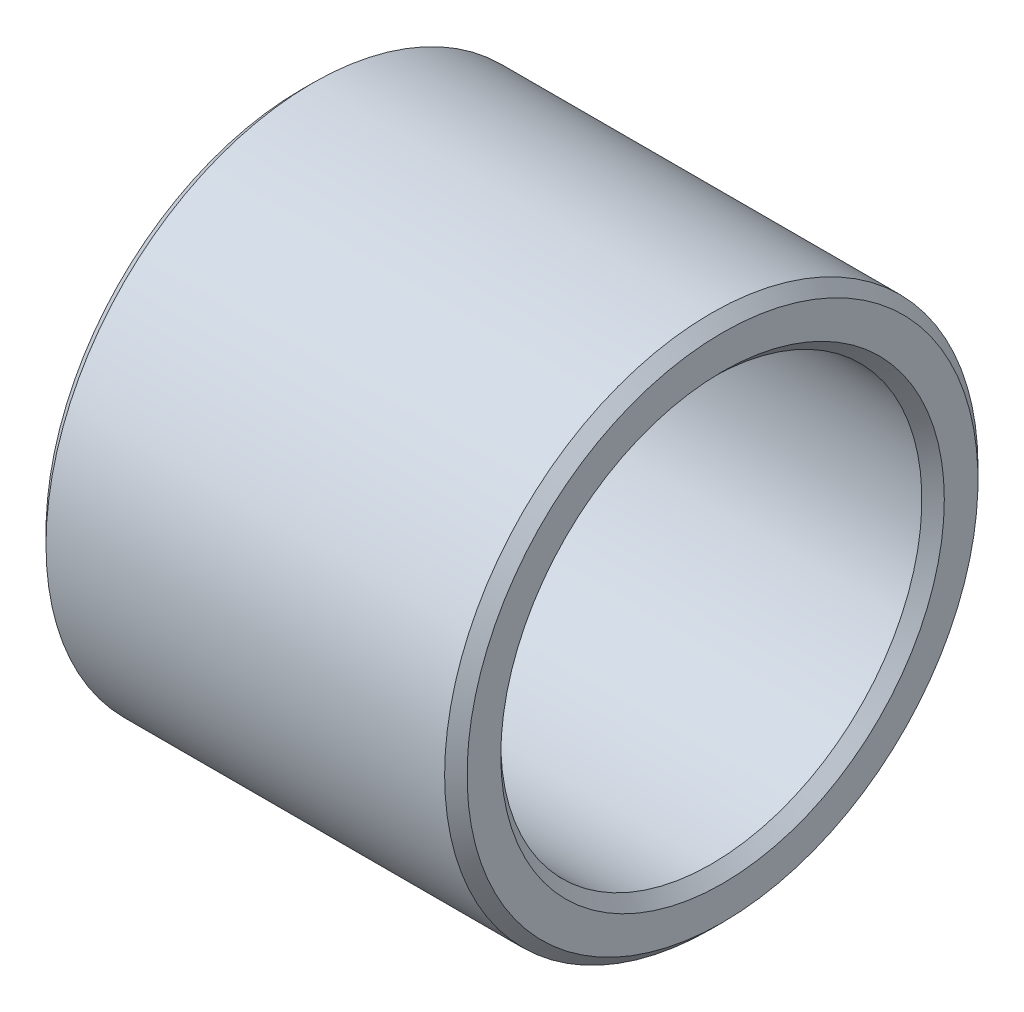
ISO-10303-21;
HEADER;
FILE_DESCRIPTION(('STEP AP214'),'2;1');
FILE_NAME('part.step','',(''),(''),'','','');
FILE_SCHEMA(('AUTOMOTIVE_DESIGN { 1 0 10303 214 1 1 1 1 }'));
ENDSEC;
DATA;
#1=APPLICATION_CONTEXT('core data for automotive mechanical design processes');
#2=APPLICATION_PROTOCOL_DEFINITION('international standard','automotive_design',2000,#1);
#3=PRODUCT_CONTEXT('',#1,'mechanical');
#4=PRODUCT('Part','Part','',(#3));
#5=PRODUCT_RELATED_PRODUCT_CATEGORY('part','',(#4));
#6=PRODUCT_DEFINITION_FORMATION('','',#4);
#7=PRODUCT_DEFINITION_CONTEXT('part definition',#1,'design');
#8=PRODUCT_DEFINITION('design','',#6,#7);
#9=PRODUCT_DEFINITION_SHAPE('','',#8);
#10=(LENGTH_UNIT() NAMED_UNIT(*) SI_UNIT(.MILLI.,.METRE.));
#11=(NAMED_UNIT(*) PLANE_ANGLE_UNIT() SI_UNIT($,.RADIAN.));
#12=(NAMED_UNIT(*) SI_UNIT($,.STERADIAN.) SOLID_ANGLE_UNIT());
#13=UNCERTAINTY_MEASURE_WITH_UNIT(LENGTH_MEASURE(1.E-05),#10,'distance_accuracy_value','');
#14=(GEOMETRIC_REPRESENTATION_CONTEXT(3) GLOBAL_UNCERTAINTY_ASSIGNED_CONTEXT((#13)) GLOBAL_UNIT_ASSIGNED_CONTEXT((#10,
#11,#12)) REPRESENTATION_CONTEXT('',''));
#15=CARTESIAN_POINT('',(0.,0.,0.));
#16=DIRECTION('',(0.,0.,1.));
#17=DIRECTION('',(1.,0.,0.));
#18=AXIS2_PLACEMENT_3D('',#15,#16,#17);
#19=CARTESIAN_POINT('',(0.,-8.5,0.));
#20=DIRECTION('',(-1.,0.,0.));
#21=DIRECTION('',(0.,1.,0.));
#22=AXIS2_PLACEMENT_3D('',#19,#20,#21);
#23=PLANE('',#22);
#24=CARTESIAN_POINT('',(0.,0.,0.));
#25=DIRECTION('',(1.,0.,0.));
#26=DIRECTION('',(0.,-1.,0.));
#27=AXIS2_PLACEMENT_3D('',#24,#25,#26);
#28=CIRCLE('',#27,7.9);
#29=CARTESIAN_POINT('',(0.,-7.9,0.));
#30=VERTEX_POINT('',#29);
#31=EDGE_CURVE('E9',#30,#30,#28,.T.);
#32=ORIENTED_EDGE('',*,*,#31,.T.);
#33=EDGE_LOOP('',(#32));
#34=FACE_BOUND('',#33,.T.);
#35=CARTESIAN_POINT('',(0.,0.,0.));
#36=DIRECTION('',(1.,0.,0.));
#37=DIRECTION('',(0.,-1.,0.));
#38=AXIS2_PLACEMENT_3D('',#35,#36,#37);
#39=CIRCLE('',#38,9.1);
#40=CARTESIAN_POINT('',(0.,-9.1,0.));
#41=VERTEX_POINT('',#40);
#42=EDGE_CURVE('E56',#41,#41,#39,.T.);
#43=ORIENTED_EDGE('',*,*,#42,.F.);
#44=EDGE_LOOP('',(#43));
#45=FACE_BOUND('',#44,.T.);
#46=ADVANCED_FACE('F15',(#34,#45),#23,.T.);
#47=CARTESIAN_POINT('',(0.2,0.,0.));
#48=DIRECTION('',(-1.,0.,0.));
#49=DIRECTION('',(0.,-1.,0.));
#50=AXIS2_PLACEMENT_3D('',#47,#48,#49);
#51=CONICAL_SURFACE('',#50,7.7,0.785398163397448);
#52=CARTESIAN_POINT('',(0.4,0.,0.));
#53=DIRECTION('',(1.,0.,0.));
#54=DIRECTION('',(0.,-1.,0.));
#55=AXIS2_PLACEMENT_3D('',#52,#53,#54);
#56=CIRCLE('',#55,7.5);
#57=CARTESIAN_POINT('',(0.4,-7.5,0.));
#58=VERTEX_POINT('',#57);
#59=EDGE_CURVE('E22',#58,#58,#56,.T.);
#60=ORIENTED_EDGE('',*,*,#59,.T.);
#61=EDGE_LOOP('',(#60));
#62=FACE_BOUND('',#61,.T.);
#63=ORIENTED_EDGE('',*,*,#31,.F.);
#64=EDGE_LOOP('',(#63));
#65=FACE_BOUND('',#64,.T.);
#66=ADVANCED_FACE('F81',(#62,#65),#51,.F.);
#67=CARTESIAN_POINT('',(7.5,0.,0.));
#68=DIRECTION('',(-1.,0.,0.));
#69=DIRECTION('',(0.,-1.,0.));
#70=AXIS2_PLACEMENT_3D('',#67,#68,#69);
#71=CYLINDRICAL_SURFACE('',#70,7.5);
#72=CARTESIAN_POINT('',(14.6,0.,0.));
#73=DIRECTION('',(1.,0.,0.));
#74=DIRECTION('',(0.,-1.,0.));
#75=AXIS2_PLACEMENT_3D('',#72,#73,#74);
#76=CIRCLE('',#75,7.5);
#77=CARTESIAN_POINT('',(14.6,-7.5,0.));
#78=VERTEX_POINT('',#77);
#79=EDGE_CURVE('E47',#78,#78,#76,.T.);
#80=ORIENTED_EDGE('',*,*,#79,.T.);
#81=EDGE_LOOP('',(#80));
#82=FACE_BOUND('',#81,.T.);
#83=ORIENTED_EDGE('',*,*,#59,.F.);
#84=EDGE_LOOP('',(#83));
#85=FACE_BOUND('',#84,.T.);
#86=ADVANCED_FACE('F85',(#82,#85),#71,.F.);
#87=CARTESIAN_POINT('',(14.8,0.,0.));
#88=DIRECTION('',(1.,0.,0.));
#89=DIRECTION('',(0.,-1.,0.));
#90=AXIS2_PLACEMENT_3D('',#87,#88,#89);
#91=CONICAL_SURFACE('',#90,7.7,0.785398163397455);
#92=CARTESIAN_POINT('',(15.,0.,0.));
#93=DIRECTION('',(1.,0.,0.));
#94=DIRECTION('',(0.,-1.,0.));
#95=AXIS2_PLACEMENT_3D('',#92,#93,#94);
#96=CIRCLE('',#95,7.9);
#97=CARTESIAN_POINT('',(15.,-7.9,0.));
#98=VERTEX_POINT('',#97);
#99=EDGE_CURVE('E43',#98,#98,#96,.T.);
#100=ORIENTED_EDGE('',*,*,#99,.T.);
#101=EDGE_LOOP('',(#100));
#102=FACE_BOUND('',#101,.T.);
#103=ORIENTED_EDGE('',*,*,#79,.F.);
#104=EDGE_LOOP('',(#103));
#105=FACE_BOUND('',#104,.T.);
#106=ADVANCED_FACE('F44',(#102,#105),#91,.F.);
#107=CARTESIAN_POINT('',(15.,-8.5,0.));
#108=DIRECTION('',(1.,0.,0.));
#109=DIRECTION('',(0.,-1.,0.));
#110=AXIS2_PLACEMENT_3D('',#107,#108,#109);
#111=PLANE('',#110);
#112=CARTESIAN_POINT('',(15.,0.,0.));
#113=DIRECTION('',(1.,0.,0.));
#114=DIRECTION('',(0.,-1.,0.));
#115=AXIS2_PLACEMENT_3D('',#112,#113,#114);
#116=CIRCLE('',#115,9.1);
#117=CARTESIAN_POINT('',(15.,-9.1,0.));
#118=VERTEX_POINT('',#117);
#119=EDGE_CURVE('E48',#118,#118,#116,.T.);
#120=ORIENTED_EDGE('',*,*,#119,.T.);
#121=EDGE_LOOP('',(#120));
#122=FACE_BOUND('',#121,.T.);
#123=ORIENTED_EDGE('',*,*,#99,.F.);
#124=EDGE_LOOP('',(#123));
#125=FACE_BOUND('',#124,.T.);
#126=ADVANCED_FACE('F92',(#122,#125),#111,.T.);
#127=CARTESIAN_POINT('',(14.8,0.,0.));
#128=DIRECTION('',(-1.,0.,0.));
#129=DIRECTION('',(0.,-1.,0.));
#130=AXIS2_PLACEMENT_3D('',#127,#128,#129);
#131=CONICAL_SURFACE('',#130,9.3,0.785398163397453);
#132=CARTESIAN_POINT('',(14.6,0.,0.));
#133=DIRECTION('',(1.,0.,0.));
#134=DIRECTION('',(0.,-1.,0.));
#135=AXIS2_PLACEMENT_3D('',#132,#133,#134);
#136=CIRCLE('',#135,9.5);
#137=CARTESIAN_POINT('',(14.6,-9.5,0.));
#138=VERTEX_POINT('',#137);
#139=EDGE_CURVE('E51',#138,#138,#136,.T.);
#140=ORIENTED_EDGE('',*,*,#139,.T.);
#141=EDGE_LOOP('',(#140));
#142=FACE_BOUND('',#141,.T.);
#143=ORIENTED_EDGE('',*,*,#119,.F.);
#144=EDGE_LOOP('',(#143));
#145=FACE_BOUND('',#144,.T.);
#146=ADVANCED_FACE('F77',(#142,#145),#131,.T.);
#147=CARTESIAN_POINT('',(7.5,0.,0.));
#148=DIRECTION('',(-1.,0.,0.));
#149=DIRECTION('',(0.,-1.,0.));
#150=AXIS2_PLACEMENT_3D('',#147,#148,#149);
#151=CYLINDRICAL_SURFACE('',#150,9.5);
#152=CARTESIAN_POINT('',(0.4,0.,0.));
#153=DIRECTION('',(1.,0.,0.));
#154=DIRECTION('',(0.,-1.,0.));
#155=AXIS2_PLACEMENT_3D('',#152,#153,#154);
#156=CIRCLE('',#155,9.5);
#157=CARTESIAN_POINT('',(0.4,-9.5,0.));
#158=VERTEX_POINT('',#157);
#159=EDGE_CURVE('E59',#158,#158,#156,.T.);
#160=ORIENTED_EDGE('',*,*,#159,.T.);
#161=EDGE_LOOP('',(#160));
#162=FACE_BOUND('',#161,.T.);
#163=ORIENTED_EDGE('',*,*,#139,.F.);
#164=EDGE_LOOP('',(#163));
#165=FACE_BOUND('',#164,.T.);
#166=ADVANCED_FACE('F64',(#162,#165),#151,.T.);
#167=CARTESIAN_POINT('',(0.2,0.,0.));
#168=DIRECTION('',(1.,0.,0.));
#169=DIRECTION('',(0.,-1.,0.));
#170=AXIS2_PLACEMENT_3D('',#167,#168,#169);
#171=CONICAL_SURFACE('',#170,9.3,0.785398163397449);
#172=ORIENTED_EDGE('',*,*,#42,.T.);
#173=EDGE_LOOP('',(#172));
#174=FACE_BOUND('',#173,.T.);
#175=ORIENTED_EDGE('',*,*,#159,.F.);
#176=EDGE_LOOP('',(#175));
#177=FACE_BOUND('',#176,.T.);
#178=ADVANCED_FACE('F69',(#174,#177),#171,.T.);
#179=CLOSED_SHELL('',(#46,#66,#86,#106,#126,#146,#166,#178));
#180=MANIFOLD_SOLID_BREP('B1',#179);
#181=ADVANCED_BREP_SHAPE_REPRESENTATION('',(#18,#180),#14);
#182=SHAPE_DEFINITION_REPRESENTATION(#9,#181);
ENDSEC;
END-ISO-10303-21;
